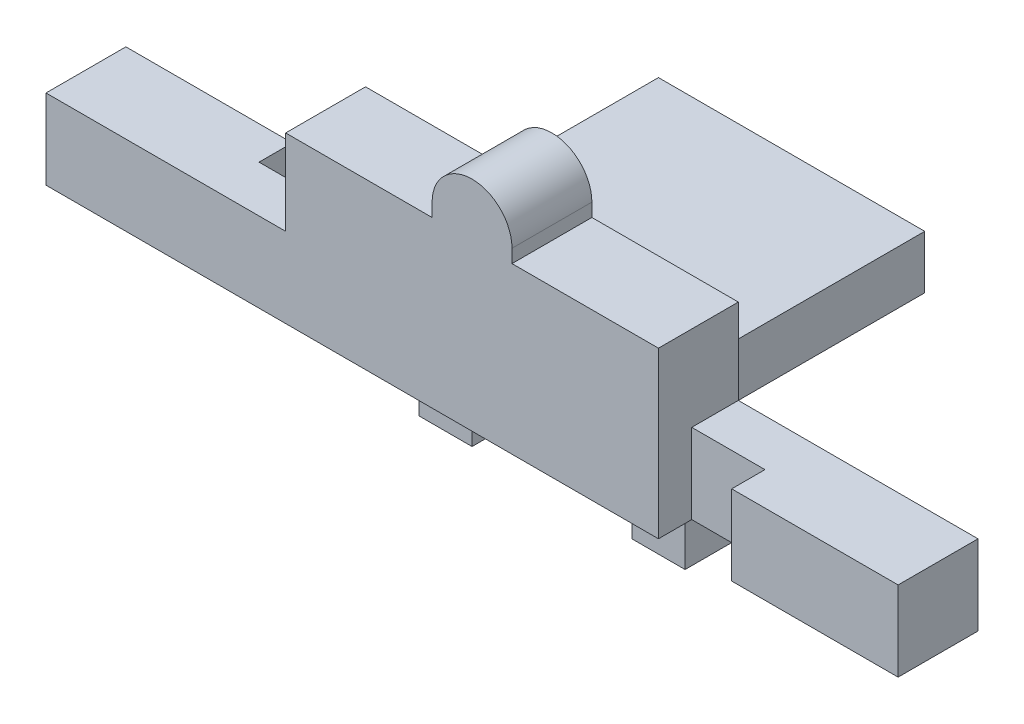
from build123d import *

# Parameters (mm, degrees)
SKETCH2_W                = 14
SKETCH2_H                = 5.2
BOSS_EXTRUDE1_DEPTH      = 3
SKETCH3_W                = 10
SKETCH3_H                = 12
BOSS_EXTRUDE2_DEPTH      = 2
BOSS_EXTRUDE3_DEPTH      = 1
BOSS_EXTRUDE3_DEPTH_BACK = 2
SKETCH6_W                = 2
SKETCH6_H                = 1.754420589
SKETCH6_H_2              = 1.75
BOSS_EXTRUDE4_DEPTH      = 4.5
SKETCH7_W                = 14
SKETCH7_H                = 3
BOSS_EXTRUDE5_DEPTH      = 1


with BuildPart() as part:
    # Sketch2 → Boss-Extrude1 (new body)
    with BuildSketch(Plane.XY):
        with Locations((-7, 2.6)):
            Rectangle(SKETCH2_W, SKETCH2_H)
        with BuildLine():
            Line((-5.5, 5.7), (-5.5, 4.7))
            ThreePointArc((-5.5, 4.7), (-7, 3.2), (-8.5, 4.7))
            Line((-8.5, 4.7), (-8.5, 5.7))
            ThreePointArc((-8.5, 5.7), (-7, 7.2), (-5.5, 5.7))
        make_face()
    extrude(amount=BOSS_EXTRUDE1_DEPTH)

    # Sketch3 → Boss-Extrude2 (add)
    with BuildSketch(Plane.XZ):
        with Locations((-7, -3)):
            Rectangle(SKETCH3_W, SKETCH3_H)
    extrude(amount=-BOSS_EXTRUDE2_DEPTH)

    # Sketch4 → Boss-Extrude3 (add, two sides: drawn at the far end of the back side and taken through both)
    with BuildSketch(Plane.XZ.offset(-BOSS_EXTRUDE3_DEPTH_BACK)):
        Polygon((-14, 1.25), (-14, 3), (-23, 3), (-23, 0), (-16.75, 0), (-16.75, 1.25), align=None)
        Polygon((9, 3), (2.75, 3), (2.75, 1.75), (0, 1.75), (0, 0), (9, 0), align=None)
    extrude(amount=BOSS_EXTRUDE3_DEPTH + BOSS_EXTRUDE3_DEPTH_BACK)

    # Sketch6 → Boss-Extrude4 (add)
    with BuildSketch(Plane.XZ):
        with Locations((-11, -0.877210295)):
            Rectangle(SKETCH6_W, SKETCH6_H)
        with Locations((-3, -0.875)):
            Rectangle(SKETCH6_W, SKETCH6_H_2)
    extrude(amount=BOSS_EXTRUDE4_DEPTH)

    # Sketch7 → Boss-Extrude5 (add)
    with BuildSketch(Plane.XZ):
        with Locations((-7, 1.5)):
            Rectangle(SKETCH7_W, SKETCH7_H)
    extrude(amount=BOSS_EXTRUDE5_DEPTH)


solid = part.part
